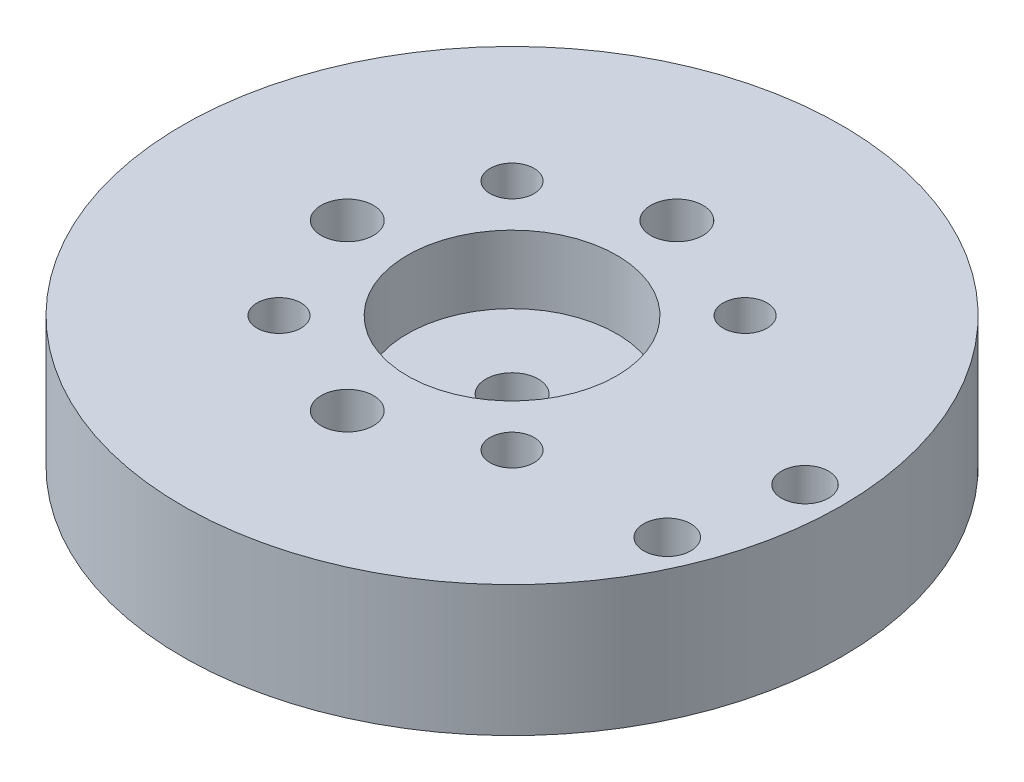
ISO-10303-21;
HEADER;
FILE_DESCRIPTION(('STEP AP214'),'2;1');
FILE_NAME('part.step','',(''),(''),'','','');
FILE_SCHEMA(('AUTOMOTIVE_DESIGN { 1 0 10303 214 1 1 1 1 }'));
ENDSEC;
DATA;
#1=APPLICATION_CONTEXT('core data for automotive mechanical design processes');
#2=APPLICATION_PROTOCOL_DEFINITION('international standard','automotive_design',2000,#1);
#3=PRODUCT_CONTEXT('',#1,'mechanical');
#4=PRODUCT('Part','Part','',(#3));
#5=PRODUCT_RELATED_PRODUCT_CATEGORY('part','',(#4));
#6=PRODUCT_DEFINITION_FORMATION('','',#4);
#7=PRODUCT_DEFINITION_CONTEXT('part definition',#1,'design');
#8=PRODUCT_DEFINITION('design','',#6,#7);
#9=PRODUCT_DEFINITION_SHAPE('','',#8);
#10=(LENGTH_UNIT() NAMED_UNIT(*) SI_UNIT(.MILLI.,.METRE.));
#11=(NAMED_UNIT(*) PLANE_ANGLE_UNIT() SI_UNIT($,.RADIAN.));
#12=(NAMED_UNIT(*) SI_UNIT($,.STERADIAN.) SOLID_ANGLE_UNIT());
#13=UNCERTAINTY_MEASURE_WITH_UNIT(LENGTH_MEASURE(1.E-05),#10,'distance_accuracy_value','');
#14=(GEOMETRIC_REPRESENTATION_CONTEXT(3) GLOBAL_UNCERTAINTY_ASSIGNED_CONTEXT((#13)) GLOBAL_UNIT_ASSIGNED_CONTEXT((#10,
#11,#12)) REPRESENTATION_CONTEXT('',''));
#15=CARTESIAN_POINT('',(0.,0.,0.));
#16=DIRECTION('',(0.,0.,1.));
#17=DIRECTION('',(1.,0.,0.));
#18=AXIS2_PLACEMENT_3D('',#15,#16,#17);
#19=CARTESIAN_POINT('',(3.67425338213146E-13,692.99976024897,94.5000000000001));
#20=DIRECTION('',(0.,1.,0.));
#21=DIRECTION('',(-1.,0.,0.));
#22=AXIS2_PLACEMENT_3D('',#19,#20,#21);
#23=PLANE('',#22);
#24=CARTESIAN_POINT('',(3.67425338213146E-13,692.99976024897,94.5000000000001));
#25=DIRECTION('',(0.,-1.,0.));
#26=DIRECTION('',(1.,0.,0.));
#27=AXIS2_PLACEMENT_3D('',#24,#25,#26);
#28=CIRCLE('',#27,16.75);
#29=CARTESIAN_POINT('',(16.7500000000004,692.99976024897,94.5000000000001));
#30=VERTEX_POINT('',#29);
#31=EDGE_CURVE('E180',#30,#30,#28,.T.);
#32=ORIENTED_EDGE('',*,*,#31,.T.);
#33=EDGE_LOOP('',(#32));
#34=FACE_BOUND('',#33,.T.);
#35=CARTESIAN_POINT('',(3.67425338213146E-13,692.99976024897,94.5000000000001));
#36=DIRECTION('',(0.,-1.,0.));
#37=DIRECTION('',(1.,0.,0.));
#38=AXIS2_PLACEMENT_3D('',#35,#36,#37);
#39=CIRCLE('',#38,2.5);
#40=CARTESIAN_POINT('',(2.50000000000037,692.99976024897,94.5000000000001));
#41=VERTEX_POINT('',#40);
#42=EDGE_CURVE('E186',#41,#41,#39,.F.);
#43=ORIENTED_EDGE('',*,*,#42,.T.);
#44=EDGE_LOOP('',(#43));
#45=FACE_BOUND('',#44,.T.);
#46=ADVANCED_FACE('F12',(#34,#45),#23,.F.);
#47=CARTESIAN_POINT('',(3.79745111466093E-13,697.49976024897,94.5000000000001));
#48=DIRECTION('',(0.,1.,0.));
#49=DIRECTION('',(-1.,0.,0.));
#50=AXIS2_PLACEMENT_3D('',#47,#48,#49);
#51=PLANE('',#50);
#52=CARTESIAN_POINT('',(11.1369318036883,697.499760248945,83.3630681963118));
#53=DIRECTION('',(0.,-1.,0.));
#54=DIRECTION('',(0.,0.,-1.));
#55=AXIS2_PLACEMENT_3D('',#52,#53,#54);
#56=CIRCLE('',#55,2.52499999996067);
#57=CARTESIAN_POINT('',(11.1369318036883,697.499760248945,80.8380681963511));
#58=VERTEX_POINT('',#57);
#59=EDGE_CURVE('E168',#58,#58,#56,.F.);
#60=ORIENTED_EDGE('',*,*,#59,.T.);
#61=EDGE_LOOP('',(#60));
#62=FACE_BOUND('',#61,.T.);
#63=ADVANCED_FACE('F300',(#62),#51,.T.);
#64=CARTESIAN_POINT('',(3.79745111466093E-13,697.49976024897,94.5000000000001));
#65=DIRECTION('',(0.,1.,0.));
#66=DIRECTION('',(-1.,0.,0.));
#67=AXIS2_PLACEMENT_3D('',#64,#65,#66);
#68=PLANE('',#67);
#69=CARTESIAN_POINT('',(11.1369318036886,697.499760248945,105.636931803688));
#70=DIRECTION('',(0.,-1.,0.));
#71=DIRECTION('',(1.,0.,0.));
#72=AXIS2_PLACEMENT_3D('',#69,#70,#71);
#73=CIRCLE('',#72,2.52499999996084);
#74=CARTESIAN_POINT('',(13.6619318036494,697.499760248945,105.636931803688));
#75=VERTEX_POINT('',#74);
#76=EDGE_CURVE('E162',#75,#75,#73,.F.);
#77=ORIENTED_EDGE('',*,*,#76,.T.);
#78=EDGE_LOOP('',(#77));
#79=FACE_BOUND('',#78,.T.);
#80=ADVANCED_FACE('F297',(#79),#68,.T.);
#81=CARTESIAN_POINT('',(3.79745111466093E-13,697.49976024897,94.5000000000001));
#82=DIRECTION('',(0.,1.,0.));
#83=DIRECTION('',(-1.,0.,0.));
#84=AXIS2_PLACEMENT_3D('',#81,#82,#83);
#85=PLANE('',#84);
#86=CARTESIAN_POINT('',(-11.1369318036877,697.499760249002,105.636931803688));
#87=DIRECTION('',(0.,-1.,0.));
#88=DIRECTION('',(1.,0.,0.));
#89=AXIS2_PLACEMENT_3D('',#86,#87,#88);
#90=CIRCLE('',#89,2.52499999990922);
#91=CARTESIAN_POINT('',(-8.61193180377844,697.499760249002,105.636931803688));
#92=VERTEX_POINT('',#91);
#93=EDGE_CURVE('E156',#92,#92,#90,.F.);
#94=ORIENTED_EDGE('',*,*,#93,.T.);
#95=EDGE_LOOP('',(#94));
#96=FACE_BOUND('',#95,.T.);
#97=ADVANCED_FACE('F293',(#96),#85,.T.);
#98=CARTESIAN_POINT('',(3.79745111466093E-13,697.49976024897,94.5000000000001));
#99=DIRECTION('',(0.,1.,0.));
#100=DIRECTION('',(-1.,0.,0.));
#101=AXIS2_PLACEMENT_3D('',#98,#99,#100);
#102=PLANE('',#101);
#103=CARTESIAN_POINT('',(-11.1369318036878,697.499760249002,83.363068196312));
#104=DIRECTION('',(0.,-1.,0.));
#105=DIRECTION('',(1.,0.,0.));
#106=AXIS2_PLACEMENT_3D('',#103,#104,#105);
#107=CIRCLE('',#106,2.52499999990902);
#108=CARTESIAN_POINT('',(-8.61193180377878,697.499760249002,83.363068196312));
#109=VERTEX_POINT('',#108);
#110=EDGE_CURVE('E150',#109,#109,#107,.F.);
#111=ORIENTED_EDGE('',*,*,#110,.T.);
#112=EDGE_LOOP('',(#111));
#113=FACE_BOUND('',#112,.T.);
#114=ADVANCED_FACE('F197',(#113),#102,.T.);
#115=CARTESIAN_POINT('',(3.79745111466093E-13,697.49976024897,94.5000000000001));
#116=DIRECTION('',(0.,-1.,0.));
#117=DIRECTION('',(1.,0.,0.));
#118=AXIS2_PLACEMENT_3D('',#115,#116,#117);
#119=CYLINDRICAL_SURFACE('',#118,2.5);
#120=ORIENTED_EDGE('',*,*,#42,.F.);
#121=EDGE_LOOP('',(#120));
#122=FACE_BOUND('',#121,.T.);
#123=CARTESIAN_POINT('',(3.79745111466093E-13,697.49976024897,94.5000000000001));
#124=DIRECTION('',(0.,-1.,0.));
#125=DIRECTION('',(1.,0.,0.));
#126=AXIS2_PLACEMENT_3D('',#123,#124,#125);
#127=CIRCLE('',#126,2.5);
#128=CARTESIAN_POINT('',(2.50000000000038,697.49976024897,94.5000000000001));
#129=VERTEX_POINT('',#128);
#130=EDGE_CURVE('E144',#129,#129,#127,.T.);
#131=ORIENTED_EDGE('',*,*,#130,.F.);
#132=EDGE_LOOP('',(#131));
#133=FACE_BOUND('',#132,.T.);
#134=ADVANCED_FACE('F193',(#122,#133),#119,.F.);
#135=CARTESIAN_POINT('',(28.0000000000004,697.49976024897,94.5000000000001));
#136=DIRECTION('',(0.,-1.,0.));
#137=DIRECTION('',(1.,0.,0.));
#138=AXIS2_PLACEMENT_3D('',#135,#136,#137);
#139=CYLINDRICAL_SURFACE('',#138,2.);
#140=CARTESIAN_POINT('',(28.0000000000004,691.49976024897,94.5000000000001));
#141=DIRECTION('',(0.,-1.,0.));
#142=DIRECTION('',(1.,0.,0.));
#143=AXIS2_PLACEMENT_3D('',#140,#141,#142);
#144=CIRCLE('',#143,2.);
#145=CARTESIAN_POINT('',(30.0000000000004,691.49976024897,94.5000000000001));
#146=VERTEX_POINT('',#145);
#147=EDGE_CURVE('E138',#146,#146,#144,.T.);
#148=ORIENTED_EDGE('',*,*,#147,.T.);
#149=EDGE_LOOP('',(#148));
#150=FACE_BOUND('',#149,.T.);
#151=CARTESIAN_POINT('',(28.0000000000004,697.49976024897,94.5000000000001));
#152=DIRECTION('',(0.,-1.,0.));
#153=DIRECTION('',(1.,0.,0.));
#154=AXIS2_PLACEMENT_3D('',#151,#152,#153);
#155=CIRCLE('',#154,2.);
#156=CARTESIAN_POINT('',(30.0000000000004,697.49976024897,94.5000000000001));
#157=VERTEX_POINT('',#156);
#158=EDGE_CURVE('E174',#157,#157,#155,.T.);
#159=ORIENTED_EDGE('',*,*,#158,.F.);
#160=EDGE_LOOP('',(#159));
#161=FACE_BOUND('',#160,.T.);
#162=ADVANCED_FACE('F196',(#150,#161),#139,.F.);
#163=CARTESIAN_POINT('',(4.97128333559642E-13,740.375914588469,94.5000000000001));
#164=DIRECTION('',(0.,-1.,0.));
#165=DIRECTION('',(1.,0.,0.));
#166=AXIS2_PLACEMENT_3D('',#163,#164,#165);
#167=CYLINDRICAL_SURFACE('',#166,16.75);
#168=ORIENTED_EDGE('',*,*,#31,.F.);
#169=EDGE_LOOP('',(#168));
#170=FACE_BOUND('',#169,.T.);
#171=CARTESIAN_POINT('',(3.63318747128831E-13,691.499760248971,94.5000000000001));
#172=DIRECTION('',(0.,-1.,0.));
#173=DIRECTION('',(1.,0.,0.));
#174=AXIS2_PLACEMENT_3D('',#171,#172,#173);
#175=CIRCLE('',#174,16.75);
#176=CARTESIAN_POINT('',(16.7500000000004,691.499760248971,94.5000000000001));
#177=VERTEX_POINT('',#176);
#178=EDGE_CURVE('E132',#177,#177,#175,.T.);
#179=ORIENTED_EDGE('',*,*,#178,.T.);
#180=EDGE_LOOP('',(#179));
#181=FACE_BOUND('',#180,.T.);
#182=ADVANCED_FACE('F278',(#170,#181),#167,.F.);
#183=CARTESIAN_POINT('',(3.79745111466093E-13,697.49976024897,94.5000000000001));
#184=DIRECTION('',(0.,1.,0.));
#185=DIRECTION('',(-1.,0.,0.));
#186=AXIS2_PLACEMENT_3D('',#183,#184,#185);
#187=PLANE('',#186);
#188=CARTESIAN_POINT('',(28.0000000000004,697.49976024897,94.5000000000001));
#189=DIRECTION('',(0.,-1.,0.));
#190=DIRECTION('',(1.,0.,0.));
#191=AXIS2_PLACEMENT_3D('',#188,#189,#190);
#192=CIRCLE('',#191,2.25);
#193=CARTESIAN_POINT('',(30.2500000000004,697.49976024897,94.5000000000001));
#194=VERTEX_POINT('',#193);
#195=EDGE_CURVE('E126',#194,#194,#192,.F.);
#196=ORIENTED_EDGE('',*,*,#195,.T.);
#197=EDGE_LOOP('',(#196));
#198=FACE_BOUND('',#197,.T.);
#199=ORIENTED_EDGE('',*,*,#158,.T.);
#200=EDGE_LOOP('',(#199));
#201=FACE_BOUND('',#200,.T.);
#202=ADVANCED_FACE('F274',(#198,#201),#187,.T.);
#203=CARTESIAN_POINT('',(3.79745111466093E-13,697.49976024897,94.5000000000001));
#204=DIRECTION('',(0.,1.,0.));
#205=DIRECTION('',(-1.,0.,0.));
#206=AXIS2_PLACEMENT_3D('',#203,#204,#205);
#207=PLANE('',#206);
#208=CARTESIAN_POINT('',(25.7741358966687,697.49976024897,105.4404715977));
#209=DIRECTION('',(0.,-1.,0.));
#210=DIRECTION('',(1.,0.,0.));
#211=AXIS2_PLACEMENT_3D('',#208,#209,#210);
#212=CIRCLE('',#211,2.25);
#213=CARTESIAN_POINT('',(28.0241358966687,697.49976024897,105.4404715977));
#214=VERTEX_POINT('',#213);
#215=EDGE_CURVE('E120',#214,#214,#212,.F.);
#216=ORIENTED_EDGE('',*,*,#215,.T.);
#217=EDGE_LOOP('',(#216));
#218=FACE_BOUND('',#217,.T.);
#219=ADVANCED_FACE('F277',(#218),#207,.T.);
#220=CARTESIAN_POINT('',(3.79745111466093E-13,697.49976024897,94.5000000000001));
#221=DIRECTION('',(0.,1.,0.));
#222=DIRECTION('',(-1.,0.,0.));
#223=AXIS2_PLACEMENT_3D('',#220,#221,#222);
#224=PLANE('',#223);
#225=CARTESIAN_POINT('',(3.67789130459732E-13,697.49976024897,110.25));
#226=DIRECTION('',(0.,-1.,0.));
#227=DIRECTION('',(1.,0.,0.));
#228=AXIS2_PLACEMENT_3D('',#225,#226,#227);
#229=CIRCLE('',#228,2.5);
#230=CARTESIAN_POINT('',(2.50000000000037,697.49976024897,110.25));
#231=VERTEX_POINT('',#230);
#232=EDGE_CURVE('E114',#231,#231,#229,.F.);
#233=ORIENTED_EDGE('',*,*,#232,.T.);
#234=EDGE_LOOP('',(#233));
#235=FACE_BOUND('',#234,.T.);
#236=ADVANCED_FACE('F382',(#235),#224,.T.);
#237=CARTESIAN_POINT('',(3.79745111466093E-13,697.49976024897,94.5000000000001));
#238=DIRECTION('',(0.,1.,0.));
#239=DIRECTION('',(-1.,0.,0.));
#240=AXIS2_PLACEMENT_3D('',#237,#238,#239);
#241=PLANE('',#240);
#242=CARTESIAN_POINT('',(-15.7499999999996,697.49976024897,94.5000000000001));
#243=DIRECTION('',(0.,-1.,0.));
#244=DIRECTION('',(1.,0.,0.));
#245=AXIS2_PLACEMENT_3D('',#242,#243,#244);
#246=CIRCLE('',#245,2.5);
#247=CARTESIAN_POINT('',(-13.2499999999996,697.49976024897,94.5000000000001));
#248=VERTEX_POINT('',#247);
#249=EDGE_CURVE('E108',#248,#248,#246,.F.);
#250=ORIENTED_EDGE('',*,*,#249,.T.);
#251=EDGE_LOOP('',(#250));
#252=FACE_BOUND('',#251,.T.);
#253=ADVANCED_FACE('F378',(#252),#241,.T.);
#254=CARTESIAN_POINT('',(3.79745111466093E-13,697.49976024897,94.5000000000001));
#255=DIRECTION('',(0.,1.,0.));
#256=DIRECTION('',(-1.,0.,0.));
#257=AXIS2_PLACEMENT_3D('',#254,#255,#256);
#258=PLANE('',#257);
#259=CARTESIAN_POINT('',(3.91701092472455E-13,697.49976024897,78.7500000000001));
#260=DIRECTION('',(0.,-1.,0.));
#261=DIRECTION('',(1.,0.,0.));
#262=AXIS2_PLACEMENT_3D('',#259,#260,#261);
#263=CIRCLE('',#262,2.5);
#264=CARTESIAN_POINT('',(2.50000000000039,697.49976024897,78.7500000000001));
#265=VERTEX_POINT('',#264);
#266=EDGE_CURVE('E103',#265,#265,#263,.F.);
#267=ORIENTED_EDGE('',*,*,#266,.T.);
#268=EDGE_LOOP('',(#267));
#269=FACE_BOUND('',#268,.T.);
#270=ADVANCED_FACE('F314',(#269),#258,.T.);
#271=CARTESIAN_POINT('',(11.1369318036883,697.499760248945,83.3630681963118));
#272=DIRECTION('',(0.,-1.,0.));
#273=DIRECTION('',(0.,0.,-1.));
#274=AXIS2_PLACEMENT_3D('',#271,#272,#273);
#275=CONICAL_SURFACE('',#274,2.52499999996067,0.785398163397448);
#276=ORIENTED_EDGE('',*,*,#59,.F.);
#277=EDGE_LOOP('',(#276));
#278=FACE_BOUND('',#277,.T.);
#279=CARTESIAN_POINT('',(11.1369318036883,697.92476024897,83.3630681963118));
#280=DIRECTION('',(0.,-1.,0.));
#281=DIRECTION('',(1.,0.,0.));
#282=AXIS2_PLACEMENT_3D('',#279,#280,#281);
#283=CIRCLE('',#282,2.1);
#284=CARTESIAN_POINT('',(13.2369318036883,697.92476024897,83.3630681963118));
#285=VERTEX_POINT('',#284);
#286=EDGE_CURVE('E107',#285,#285,#283,.F.);
#287=ORIENTED_EDGE('',*,*,#286,.T.);
#288=EDGE_LOOP('',(#287));
#289=FACE_BOUND('',#288,.T.);
#290=ADVANCED_FACE('F310',(#278,#289),#275,.F.);
#291=CARTESIAN_POINT('',(11.1369318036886,697.499760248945,105.636931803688));
#292=DIRECTION('',(0.,-1.,0.));
#293=DIRECTION('',(1.,0.,0.));
#294=AXIS2_PLACEMENT_3D('',#291,#292,#293);
#295=CONICAL_SURFACE('',#294,2.5249999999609,0.785398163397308);
#296=ORIENTED_EDGE('',*,*,#76,.F.);
#297=EDGE_LOOP('',(#296));
#298=FACE_BOUND('',#297,.T.);
#299=CARTESIAN_POINT('',(11.1369318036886,697.92476024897,105.636931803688));
#300=DIRECTION('',(0.,-1.,0.));
#301=DIRECTION('',(1.,0.,0.));
#302=AXIS2_PLACEMENT_3D('',#299,#300,#301);
#303=CIRCLE('',#302,2.1);
#304=CARTESIAN_POINT('',(13.2369318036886,697.92476024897,105.636931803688));
#305=VERTEX_POINT('',#304);
#306=EDGE_CURVE('E319',#305,#305,#303,.F.);
#307=ORIENTED_EDGE('',*,*,#306,.T.);
#308=EDGE_LOOP('',(#307));
#309=FACE_BOUND('',#308,.T.);
#310=ADVANCED_FACE('F313',(#298,#309),#295,.F.);
#311=CARTESIAN_POINT('',(-11.1369318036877,697.499760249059,105.636931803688));
#312=DIRECTION('',(0.,-1.,0.));
#313=DIRECTION('',(1.,0.,0.));
#314=AXIS2_PLACEMENT_3D('',#311,#312,#313);
#315=CONICAL_SURFACE('',#314,2.52499999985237,0.785398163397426);
#316=ORIENTED_EDGE('',*,*,#93,.F.);
#317=EDGE_LOOP('',(#316));
#318=FACE_BOUND('',#317,.T.);
#319=CARTESIAN_POINT('',(-11.1369318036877,697.92476024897,105.636931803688));
#320=DIRECTION('',(0.,-1.,0.));
#321=DIRECTION('',(1.,0.,0.));
#322=AXIS2_PLACEMENT_3D('',#319,#320,#321);
#323=CIRCLE('',#322,2.1);
#324=CARTESIAN_POINT('',(-9.03693180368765,697.92476024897,105.636931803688));
#325=VERTEX_POINT('',#324);
#326=EDGE_CURVE('E322',#325,#325,#323,.F.);
#327=ORIENTED_EDGE('',*,*,#326,.T.);
#328=EDGE_LOOP('',(#327));
#329=FACE_BOUND('',#328,.T.);
#330=ADVANCED_FACE('F215',(#318,#329),#315,.F.);
#331=CARTESIAN_POINT('',(-11.1369318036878,697.499760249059,83.363068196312));
#332=DIRECTION('',(0.,-1.,0.));
#333=DIRECTION('',(1.,0.,0.));
#334=AXIS2_PLACEMENT_3D('',#331,#332,#333);
#335=CONICAL_SURFACE('',#334,2.52499999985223,0.785398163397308);
#336=ORIENTED_EDGE('',*,*,#110,.F.);
#337=EDGE_LOOP('',(#336));
#338=FACE_BOUND('',#337,.T.);
#339=CARTESIAN_POINT('',(-11.1369318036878,697.92476024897,83.363068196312));
#340=DIRECTION('',(0.,-1.,0.));
#341=DIRECTION('',(1.,0.,0.));
#342=AXIS2_PLACEMENT_3D('',#339,#340,#341);
#343=CIRCLE('',#342,2.1);
#344=CARTESIAN_POINT('',(-9.0369318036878,697.92476024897,83.363068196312));
#345=VERTEX_POINT('',#344);
#346=EDGE_CURVE('E100',#345,#345,#343,.F.);
#347=ORIENTED_EDGE('',*,*,#346,.T.);
#348=EDGE_LOOP('',(#347));
#349=FACE_BOUND('',#348,.T.);
#350=ADVANCED_FACE('F204',(#338,#349),#335,.F.);
#351=CARTESIAN_POINT('',(3.79745111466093E-13,697.49976024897,94.5000000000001));
#352=DIRECTION('',(0.,1.,0.));
#353=DIRECTION('',(-1.,0.,0.));
#354=AXIS2_PLACEMENT_3D('',#351,#352,#353);
#355=PLANE('',#354);
#356=CARTESIAN_POINT('',(3.79745111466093E-13,697.49976024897,94.5000000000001));
#357=DIRECTION('',(0.,-1.,0.));
#358=DIRECTION('',(1.,0.,0.));
#359=AXIS2_PLACEMENT_3D('',#356,#357,#358);
#360=CIRCLE('',#359,9.99999999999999);
#361=CARTESIAN_POINT('',(10.0000000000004,697.49976024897,94.5000000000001));
#362=VERTEX_POINT('',#361);
#363=EDGE_CURVE('E94',#362,#362,#360,.F.);
#364=ORIENTED_EDGE('',*,*,#363,.T.);
#365=EDGE_LOOP('',(#364));
#366=FACE_BOUND('',#365,.T.);
#367=ORIENTED_EDGE('',*,*,#130,.T.);
#368=EDGE_LOOP('',(#367));
#369=FACE_BOUND('',#368,.T.);
#370=ADVANCED_FACE('F201',(#366,#369),#355,.T.);
#371=CARTESIAN_POINT('',(3.63318747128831E-13,691.499760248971,94.5000000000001));
#372=DIRECTION('',(0.,1.,0.));
#373=DIRECTION('',(-1.,0.,0.));
#374=AXIS2_PLACEMENT_3D('',#371,#372,#373);
#375=PLANE('',#374);
#376=CARTESIAN_POINT('',(3.63318747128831E-13,691.49976024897,94.5000000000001));
#377=DIRECTION('',(0.,-1.,0.));
#378=DIRECTION('',(1.,0.,0.));
#379=AXIS2_PLACEMENT_3D('',#376,#377,#378);
#380=CIRCLE('',#379,31.5);
#381=CARTESIAN_POINT('',(31.5000000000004,691.49976024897,94.5000000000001));
#382=VERTEX_POINT('',#381);
#383=EDGE_CURVE('E88',#382,#382,#380,.F.);
#384=ORIENTED_EDGE('',*,*,#383,.F.);
#385=EDGE_LOOP('',(#384));
#386=FACE_BOUND('',#385,.T.);
#387=ORIENTED_EDGE('',*,*,#178,.F.);
#388=EDGE_LOOP('',(#387));
#389=FACE_BOUND('',#388,.T.);
#390=ORIENTED_EDGE('',*,*,#147,.F.);
#391=EDGE_LOOP('',(#390));
#392=FACE_BOUND('',#391,.T.);
#393=ADVANCED_FACE('F203',(#386,#389,#392),#375,.F.);
#394=CARTESIAN_POINT('',(28.0000000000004,703.99976024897,94.5000000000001));
#395=DIRECTION('',(0.,-1.,0.));
#396=DIRECTION('',(1.,0.,0.));
#397=AXIS2_PLACEMENT_3D('',#394,#395,#396);
#398=CYLINDRICAL_SURFACE('',#397,2.25);
#399=ORIENTED_EDGE('',*,*,#195,.F.);
#400=EDGE_LOOP('',(#399));
#401=FACE_BOUND('',#400,.T.);
#402=CARTESIAN_POINT('',(28.0000000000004,703.99976024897,94.5000000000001));
#403=DIRECTION('',(0.,-1.,0.));
#404=DIRECTION('',(1.,0.,0.));
#405=AXIS2_PLACEMENT_3D('',#402,#403,#404);
#406=CIRCLE('',#405,2.25);
#407=CARTESIAN_POINT('',(30.2500000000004,703.99976024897,94.5000000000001));
#408=VERTEX_POINT('',#407);
#409=EDGE_CURVE('E82',#408,#408,#406,.T.);
#410=ORIENTED_EDGE('',*,*,#409,.F.);
#411=EDGE_LOOP('',(#410));
#412=FACE_BOUND('',#411,.T.);
#413=ADVANCED_FACE('F212',(#401,#412),#398,.F.);
#414=CARTESIAN_POINT('',(25.7741358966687,703.99976024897,105.4404715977));
#415=DIRECTION('',(0.,-1.,0.));
#416=DIRECTION('',(1.,0.,0.));
#417=AXIS2_PLACEMENT_3D('',#414,#415,#416);
#418=CYLINDRICAL_SURFACE('',#417,2.25);
#419=ORIENTED_EDGE('',*,*,#215,.F.);
#420=EDGE_LOOP('',(#419));
#421=FACE_BOUND('',#420,.T.);
#422=CARTESIAN_POINT('',(25.7741358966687,703.99976024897,105.4404715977));
#423=DIRECTION('',(0.,-1.,0.));
#424=DIRECTION('',(1.,0.,0.));
#425=AXIS2_PLACEMENT_3D('',#422,#423,#424);
#426=CIRCLE('',#425,2.25);
#427=CARTESIAN_POINT('',(28.0241358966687,703.99976024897,105.4404715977));
#428=VERTEX_POINT('',#427);
#429=EDGE_CURVE('E76',#428,#428,#426,.T.);
#430=ORIENTED_EDGE('',*,*,#429,.F.);
#431=EDGE_LOOP('',(#430));
#432=FACE_BOUND('',#431,.T.);
#433=ADVANCED_FACE('F260',(#421,#432),#418,.F.);
#434=CARTESIAN_POINT('',(3.85584358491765E-13,703.99976024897,110.25));
#435=DIRECTION('',(0.,-1.,0.));
#436=DIRECTION('',(1.,0.,0.));
#437=AXIS2_PLACEMENT_3D('',#434,#435,#436);
#438=CYLINDRICAL_SURFACE('',#437,2.5);
#439=ORIENTED_EDGE('',*,*,#232,.F.);
#440=EDGE_LOOP('',(#439));
#441=FACE_BOUND('',#440,.T.);
#442=CARTESIAN_POINT('',(3.85584358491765E-13,703.99976024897,110.25));
#443=DIRECTION('',(0.,-1.,0.));
#444=DIRECTION('',(1.,0.,0.));
#445=AXIS2_PLACEMENT_3D('',#442,#443,#444);
#446=CIRCLE('',#445,2.5);
#447=CARTESIAN_POINT('',(2.50000000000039,703.99976024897,110.25));
#448=VERTEX_POINT('',#447);
#449=EDGE_CURVE('E70',#448,#448,#446,.T.);
#450=ORIENTED_EDGE('',*,*,#449,.F.);
#451=EDGE_LOOP('',(#450));
#452=FACE_BOUND('',#451,.T.);
#453=ADVANCED_FACE('F256',(#441,#452),#438,.F.);
#454=CARTESIAN_POINT('',(-15.7499999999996,703.99976024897,94.5000000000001));
#455=DIRECTION('',(0.,-1.,0.));
#456=DIRECTION('',(1.,0.,0.));
#457=AXIS2_PLACEMENT_3D('',#454,#455,#456);
#458=CYLINDRICAL_SURFACE('',#457,2.5);
#459=ORIENTED_EDGE('',*,*,#249,.F.);
#460=EDGE_LOOP('',(#459));
#461=FACE_BOUND('',#460,.T.);
#462=CARTESIAN_POINT('',(-15.7499999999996,703.99976024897,94.5000000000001));
#463=DIRECTION('',(0.,-1.,0.));
#464=DIRECTION('',(1.,0.,0.));
#465=AXIS2_PLACEMENT_3D('',#462,#463,#464);
#466=CIRCLE('',#465,2.5);
#467=CARTESIAN_POINT('',(-13.2499999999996,703.99976024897,94.5000000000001));
#468=VERTEX_POINT('',#467);
#469=EDGE_CURVE('E64',#468,#468,#466,.T.);
#470=ORIENTED_EDGE('',*,*,#469,.F.);
#471=EDGE_LOOP('',(#470));
#472=FACE_BOUND('',#471,.T.);
#473=ADVANCED_FACE('F252',(#461,#472),#458,.F.);
#474=CARTESIAN_POINT('',(4.09496320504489E-13,703.99976024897,78.7500000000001));
#475=DIRECTION('',(0.,-1.,0.));
#476=DIRECTION('',(1.,0.,0.));
#477=AXIS2_PLACEMENT_3D('',#474,#475,#476);
#478=CYLINDRICAL_SURFACE('',#477,2.5);
#479=ORIENTED_EDGE('',*,*,#266,.F.);
#480=EDGE_LOOP('',(#479));
#481=FACE_BOUND('',#480,.T.);
#482=CARTESIAN_POINT('',(4.09496320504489E-13,703.99976024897,78.7500000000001));
#483=DIRECTION('',(0.,-1.,0.));
#484=DIRECTION('',(1.,0.,0.));
#485=AXIS2_PLACEMENT_3D('',#482,#483,#484);
#486=CIRCLE('',#485,2.5);
#487=CARTESIAN_POINT('',(2.50000000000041,703.99976024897,78.7500000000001));
#488=VERTEX_POINT('',#487);
#489=EDGE_CURVE('E58',#488,#488,#486,.T.);
#490=ORIENTED_EDGE('',*,*,#489,.F.);
#491=EDGE_LOOP('',(#490));
#492=FACE_BOUND('',#491,.T.);
#493=ADVANCED_FACE('F248',(#481,#492),#478,.F.);
#494=CARTESIAN_POINT('',(11.1369318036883,697.49976024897,83.3630681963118));
#495=DIRECTION('',(0.,-1.,0.));
#496=DIRECTION('',(1.,0.,0.));
#497=AXIS2_PLACEMENT_3D('',#494,#495,#496);
#498=CYLINDRICAL_SURFACE('',#497,2.1);
#499=ORIENTED_EDGE('',*,*,#286,.F.);
#500=EDGE_LOOP('',(#499));
#501=FACE_BOUND('',#500,.T.);
#502=CARTESIAN_POINT('',(11.1369318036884,703.99976024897,83.3630681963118));
#503=DIRECTION('',(0.,-1.,0.));
#504=DIRECTION('',(1.,0.,0.));
#505=AXIS2_PLACEMENT_3D('',#502,#503,#504);
#506=CIRCLE('',#505,2.1);
#507=CARTESIAN_POINT('',(13.2369318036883,703.99976024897,83.3630681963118));
#508=VERTEX_POINT('',#507);
#509=EDGE_CURVE('E52',#508,#508,#506,.T.);
#510=ORIENTED_EDGE('',*,*,#509,.F.);
#511=EDGE_LOOP('',(#510));
#512=FACE_BOUND('',#511,.T.);
#513=ADVANCED_FACE('F244',(#501,#512),#498,.F.);
#514=CARTESIAN_POINT('',(11.1369318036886,697.49976024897,105.636931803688));
#515=DIRECTION('',(0.,-1.,0.));
#516=DIRECTION('',(1.,0.,0.));
#517=AXIS2_PLACEMENT_3D('',#514,#515,#516);
#518=CYLINDRICAL_SURFACE('',#517,2.1);
#519=ORIENTED_EDGE('',*,*,#306,.F.);
#520=EDGE_LOOP('',(#519));
#521=FACE_BOUND('',#520,.T.);
#522=CARTESIAN_POINT('',(11.1369318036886,703.99976024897,105.636931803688));
#523=DIRECTION('',(0.,-1.,0.));
#524=DIRECTION('',(1.,0.,0.));
#525=AXIS2_PLACEMENT_3D('',#522,#523,#524);
#526=CIRCLE('',#525,2.1);
#527=CARTESIAN_POINT('',(13.2369318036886,703.99976024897,105.636931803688));
#528=VERTEX_POINT('',#527);
#529=EDGE_CURVE('E46',#528,#528,#526,.T.);
#530=ORIENTED_EDGE('',*,*,#529,.F.);
#531=EDGE_LOOP('',(#530));
#532=FACE_BOUND('',#531,.T.);
#533=ADVANCED_FACE('F240',(#521,#532),#518,.F.);
#534=CARTESIAN_POINT('',(-11.1369318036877,697.49976024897,105.636931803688));
#535=DIRECTION('',(0.,-1.,0.));
#536=DIRECTION('',(1.,0.,0.));
#537=AXIS2_PLACEMENT_3D('',#534,#535,#536);
#538=CYLINDRICAL_SURFACE('',#537,2.1);
#539=ORIENTED_EDGE('',*,*,#326,.F.);
#540=EDGE_LOOP('',(#539));
#541=FACE_BOUND('',#540,.T.);
#542=CARTESIAN_POINT('',(-11.1369318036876,703.99976024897,105.636931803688));
#543=DIRECTION('',(0.,-1.,0.));
#544=DIRECTION('',(1.,0.,0.));
#545=AXIS2_PLACEMENT_3D('',#542,#543,#544);
#546=CIRCLE('',#545,2.1);
#547=CARTESIAN_POINT('',(-9.03693180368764,703.99976024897,105.636931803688));
#548=VERTEX_POINT('',#547);
#549=EDGE_CURVE('E40',#548,#548,#546,.T.);
#550=ORIENTED_EDGE('',*,*,#549,.F.);
#551=EDGE_LOOP('',(#550));
#552=FACE_BOUND('',#551,.T.);
#553=ADVANCED_FACE('F236',(#541,#552),#538,.F.);
#554=CARTESIAN_POINT('',(-11.1369318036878,697.49976024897,83.363068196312));
#555=DIRECTION('',(0.,-1.,0.));
#556=DIRECTION('',(1.,0.,0.));
#557=AXIS2_PLACEMENT_3D('',#554,#555,#556);
#558=CYLINDRICAL_SURFACE('',#557,2.1);
#559=ORIENTED_EDGE('',*,*,#346,.F.);
#560=EDGE_LOOP('',(#559));
#561=FACE_BOUND('',#560,.T.);
#562=CARTESIAN_POINT('',(-11.1369318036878,703.99976024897,83.363068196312));
#563=DIRECTION('',(0.,-1.,0.));
#564=DIRECTION('',(1.,0.,0.));
#565=AXIS2_PLACEMENT_3D('',#562,#563,#564);
#566=CIRCLE('',#565,2.1);
#567=CARTESIAN_POINT('',(-9.03693180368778,703.99976024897,83.363068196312));
#568=VERTEX_POINT('',#567);
#569=EDGE_CURVE('E27',#568,#568,#566,.T.);
#570=ORIENTED_EDGE('',*,*,#569,.F.);
#571=EDGE_LOOP('',(#570));
#572=FACE_BOUND('',#571,.T.);
#573=ADVANCED_FACE('F232',(#561,#572),#558,.F.);
#574=CARTESIAN_POINT('',(3.97540339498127E-13,703.99976024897,94.5000000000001));
#575=DIRECTION('',(0.,-1.,0.));
#576=DIRECTION('',(1.,0.,0.));
#577=AXIS2_PLACEMENT_3D('',#574,#575,#576);
#578=CYLINDRICAL_SURFACE('',#577,9.99999999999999);
#579=ORIENTED_EDGE('',*,*,#363,.F.);
#580=EDGE_LOOP('',(#579));
#581=FACE_BOUND('',#580,.T.);
#582=CARTESIAN_POINT('',(3.97540339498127E-13,703.99976024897,94.5000000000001));
#583=DIRECTION('',(0.,-1.,0.));
#584=DIRECTION('',(1.,0.,0.));
#585=AXIS2_PLACEMENT_3D('',#582,#583,#584);
#586=CIRCLE('',#585,9.99999999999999);
#587=CARTESIAN_POINT('',(10.0000000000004,703.99976024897,94.5000000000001));
#588=VERTEX_POINT('',#587);
#589=EDGE_CURVE('E20',#588,#588,#586,.T.);
#590=ORIENTED_EDGE('',*,*,#589,.F.);
#591=EDGE_LOOP('',(#590));
#592=FACE_BOUND('',#591,.T.);
#593=ADVANCED_FACE('F225',(#581,#592),#578,.F.);
#594=CARTESIAN_POINT('',(6.23664177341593E-13,786.595214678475,94.5000000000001));
#595=DIRECTION('',(0.,-1.,0.));
#596=DIRECTION('',(1.,0.,0.));
#597=AXIS2_PLACEMENT_3D('',#594,#595,#596);
#598=CYLINDRICAL_SURFACE('',#597,31.5);
#599=CARTESIAN_POINT('',(3.97540339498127E-13,703.99976024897,94.5000000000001));
#600=DIRECTION('',(0.,-1.,0.));
#601=DIRECTION('',(1.,0.,0.));
#602=AXIS2_PLACEMENT_3D('',#599,#600,#601);
#603=CIRCLE('',#602,31.5);
#604=CARTESIAN_POINT('',(31.5000000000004,703.99976024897,94.5000000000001));
#605=VERTEX_POINT('',#604);
#606=EDGE_CURVE('E8',#605,#605,#603,.F.);
#607=ORIENTED_EDGE('',*,*,#606,.F.);
#608=EDGE_LOOP('',(#607));
#609=FACE_BOUND('',#608,.T.);
#610=ORIENTED_EDGE('',*,*,#383,.T.);
#611=EDGE_LOOP('',(#610));
#612=FACE_BOUND('',#611,.T.);
#613=ADVANCED_FACE('F220',(#609,#612),#598,.T.);
#614=CARTESIAN_POINT('',(3.97540339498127E-13,703.99976024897,94.5000000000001));
#615=DIRECTION('',(0.,1.,0.));
#616=DIRECTION('',(-1.,0.,0.));
#617=AXIS2_PLACEMENT_3D('',#614,#615,#616);
#618=PLANE('',#617);
#619=ORIENTED_EDGE('',*,*,#606,.T.);
#620=EDGE_LOOP('',(#619));
#621=FACE_BOUND('',#620,.T.);
#622=ORIENTED_EDGE('',*,*,#589,.T.);
#623=EDGE_LOOP('',(#622));
#624=FACE_BOUND('',#623,.T.);
#625=ORIENTED_EDGE('',*,*,#569,.T.);
#626=EDGE_LOOP('',(#625));
#627=FACE_BOUND('',#626,.T.);
#628=ORIENTED_EDGE('',*,*,#549,.T.);
#629=EDGE_LOOP('',(#628));
#630=FACE_BOUND('',#629,.T.);
#631=ORIENTED_EDGE('',*,*,#529,.T.);
#632=EDGE_LOOP('',(#631));
#633=FACE_BOUND('',#632,.T.);
#634=ORIENTED_EDGE('',*,*,#509,.T.);
#635=EDGE_LOOP('',(#634));
#636=FACE_BOUND('',#635,.T.);
#637=ORIENTED_EDGE('',*,*,#489,.T.);
#638=EDGE_LOOP('',(#637));
#639=FACE_BOUND('',#638,.T.);
#640=ORIENTED_EDGE('',*,*,#469,.T.);
#641=EDGE_LOOP('',(#640));
#642=FACE_BOUND('',#641,.T.);
#643=ORIENTED_EDGE('',*,*,#449,.T.);
#644=EDGE_LOOP('',(#643));
#645=FACE_BOUND('',#644,.T.);
#646=ORIENTED_EDGE('',*,*,#429,.T.);
#647=EDGE_LOOP('',(#646));
#648=FACE_BOUND('',#647,.T.);
#649=ORIENTED_EDGE('',*,*,#409,.T.);
#650=EDGE_LOOP('',(#649));
#651=FACE_BOUND('',#650,.T.);
#652=ADVANCED_FACE('F218',(#621,#624,#627,#630,#633,#636,#639,#642,#645,#648,#651),#618,.T.);
#653=CLOSED_SHELL('',(#46,#63,#80,#97,#114,#134,#162,#182,#202,#219,#236,#253,#270,#290,#310,
#330,#350,#370,#393,#413,#433,#453,#473,#493,#513,#533,#553,#573,#593,#613,#652));
#654=MANIFOLD_SOLID_BREP('B1',#653);
#655=ADVANCED_BREP_SHAPE_REPRESENTATION('',(#18,#654),#14);
#656=SHAPE_DEFINITION_REPRESENTATION(#9,#655);
ENDSEC;
END-ISO-10303-21;
